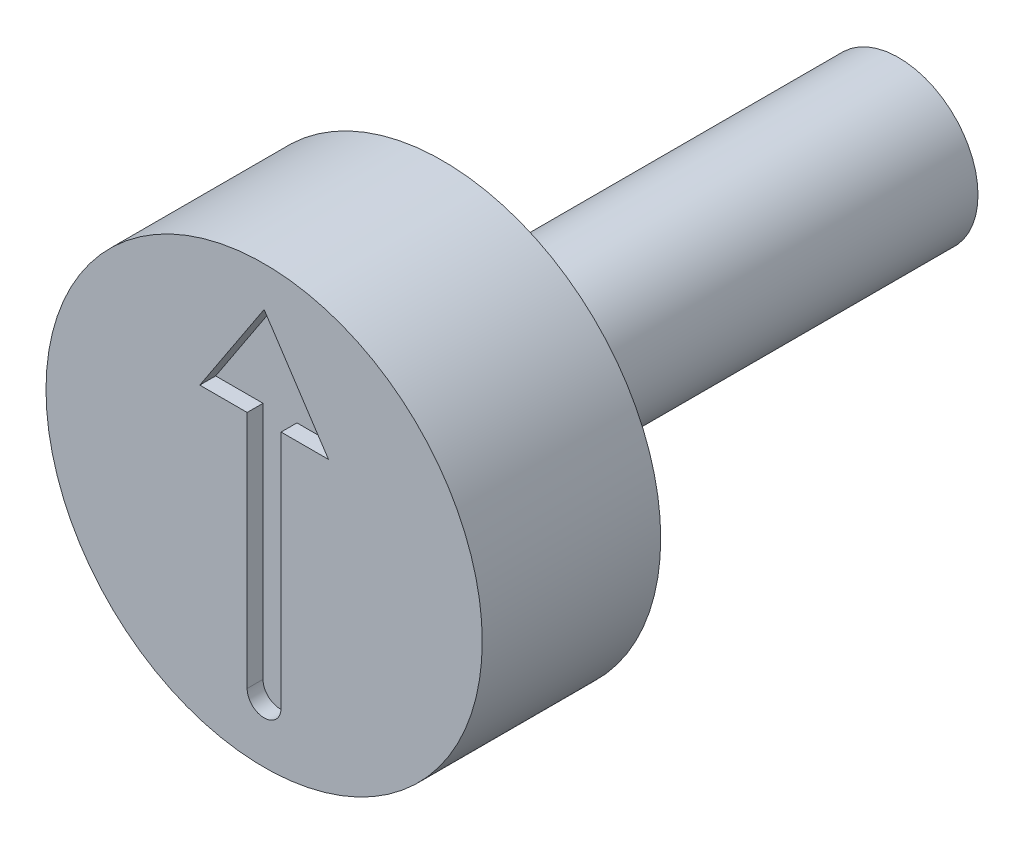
ISO-10303-21;
HEADER;
FILE_DESCRIPTION(('STEP AP214'),'2;1');
FILE_NAME('part.step','',(''),(''),'','','');
FILE_SCHEMA(('AUTOMOTIVE_DESIGN { 1 0 10303 214 1 1 1 1 }'));
ENDSEC;
DATA;
#1=APPLICATION_CONTEXT('core data for automotive mechanical design processes');
#2=APPLICATION_PROTOCOL_DEFINITION('international standard','automotive_design',2000,#1);
#3=PRODUCT_CONTEXT('',#1,'mechanical');
#4=PRODUCT('Part','Part','',(#3));
#5=PRODUCT_RELATED_PRODUCT_CATEGORY('part','',(#4));
#6=PRODUCT_DEFINITION_FORMATION('','',#4);
#7=PRODUCT_DEFINITION_CONTEXT('part definition',#1,'design');
#8=PRODUCT_DEFINITION('design','',#6,#7);
#9=PRODUCT_DEFINITION_SHAPE('','',#8);
#10=(LENGTH_UNIT() NAMED_UNIT(*) SI_UNIT(.MILLI.,.METRE.));
#11=(NAMED_UNIT(*) PLANE_ANGLE_UNIT() SI_UNIT($,.RADIAN.));
#12=(NAMED_UNIT(*) SI_UNIT($,.STERADIAN.) SOLID_ANGLE_UNIT());
#13=UNCERTAINTY_MEASURE_WITH_UNIT(LENGTH_MEASURE(1.E-05),#10,'distance_accuracy_value','');
#14=(GEOMETRIC_REPRESENTATION_CONTEXT(3) GLOBAL_UNCERTAINTY_ASSIGNED_CONTEXT((#13)) GLOBAL_UNIT_ASSIGNED_CONTEXT((#10,
#11,#12)) REPRESENTATION_CONTEXT('',''));
#15=CARTESIAN_POINT('',(0.,0.,0.));
#16=DIRECTION('',(0.,0.,1.));
#17=DIRECTION('',(1.,0.,0.));
#18=AXIS2_PLACEMENT_3D('',#15,#16,#17);
#19=CARTESIAN_POINT('',(0.,0.,0.));
#20=DIRECTION('',(0.,0.,1.));
#21=DIRECTION('',(1.,0.,0.));
#22=AXIS2_PLACEMENT_3D('',#19,#20,#21);
#23=PLANE('',#22);
#24=DIRECTION('',(1.,0.,0.));
#25=VECTOR('',#24,1.);
#26=CARTESIAN_POINT('',(0.428009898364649,2.03665157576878,0.));
#27=LINE('',#26,#25);
#28=CARTESIAN_POINT('',(0.428009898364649,2.03665157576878,0.));
#29=VERTEX_POINT('',#28);
#30=CARTESIAN_POINT('',(1.6222126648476,2.03665157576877,0.));
#31=VERTEX_POINT('',#30);
#32=EDGE_CURVE('E48',#29,#31,#27,.T.);
#33=ORIENTED_EDGE('',*,*,#32,.F.);
#34=DIRECTION('',(0.,1.,0.));
#35=VECTOR('',#34,1.);
#36=CARTESIAN_POINT('',(0.42800989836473,-3.99119224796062,0.));
#37=LINE('',#36,#35);
#38=CARTESIAN_POINT('',(0.42800989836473,-3.99119224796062,0.));
#39=VERTEX_POINT('',#38);
#40=EDGE_CURVE('E140',#39,#29,#37,.T.);
#41=ORIENTED_EDGE('',*,*,#40,.F.);
#42=CARTESIAN_POINT('',(0.,-3.99119224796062,0.));
#43=DIRECTION('',(0.,0.,1.));
#44=DIRECTION('',(1.,0.,0.));
#45=AXIS2_PLACEMENT_3D('',#42,#43,#44);
#46=CIRCLE('',#45,0.42800989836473);
#47=CARTESIAN_POINT('',(-0.42800989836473,-3.99119224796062,0.));
#48=VERTEX_POINT('',#47);
#49=EDGE_CURVE('E138',#48,#39,#46,.T.);
#50=ORIENTED_EDGE('',*,*,#49,.F.);
#51=DIRECTION('',(0.,-1.,0.));
#52=VECTOR('',#51,1.);
#53=CARTESIAN_POINT('',(-0.42800989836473,-3.99119224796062,0.));
#54=LINE('',#53,#52);
#55=CARTESIAN_POINT('',(-0.428009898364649,2.03665157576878,0.));
#56=VERTEX_POINT('',#55);
#57=EDGE_CURVE('E102',#56,#48,#54,.T.);
#58=ORIENTED_EDGE('',*,*,#57,.F.);
#59=DIRECTION('',(1.,0.,0.));
#60=VECTOR('',#59,1.);
#61=CARTESIAN_POINT('',(-0.428009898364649,2.03665157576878,0.));
#62=LINE('',#61,#60);
#63=CARTESIAN_POINT('',(-1.6222126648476,2.03665157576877,0.));
#64=VERTEX_POINT('',#63);
#65=EDGE_CURVE('E134',#64,#56,#62,.T.);
#66=ORIENTED_EDGE('',*,*,#65,.F.);
#67=DIRECTION('',(-0.550159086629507,-0.835059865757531,0.));
#68=VECTOR('',#67,1.);
#69=CARTESIAN_POINT('',(-1.6222126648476,2.03665157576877,0.));
#70=LINE('',#69,#68);
#71=CARTESIAN_POINT('',(0.,4.49892971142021,0.));
#72=VERTEX_POINT('',#71);
#73=EDGE_CURVE('E131',#72,#64,#70,.T.);
#74=ORIENTED_EDGE('',*,*,#73,.F.);
#75=DIRECTION('',(-0.550159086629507,0.835059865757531,0.));
#76=VECTOR('',#75,1.);
#77=CARTESIAN_POINT('',(1.6222126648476,2.03665157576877,0.));
#78=LINE('',#77,#76);
#79=EDGE_CURVE('E128',#31,#72,#78,.T.);
#80=ORIENTED_EDGE('',*,*,#79,.F.);
#81=EDGE_LOOP('',(#33,#41,#50,#58,#66,#74,#80));
#82=FACE_BOUND('',#81,.T.);
#83=CARTESIAN_POINT('',(0.,0.,0.));
#84=DIRECTION('',(0.,0.,1.));
#85=DIRECTION('',(1.,0.,0.));
#86=AXIS2_PLACEMENT_3D('',#83,#84,#85);
#87=CIRCLE('',#86,5.5);
#88=CARTESIAN_POINT('',(5.5,0.,0.));
#89=VERTEX_POINT('',#88);
#90=EDGE_CURVE('E11',#89,#89,#87,.T.);
#91=ORIENTED_EDGE('',*,*,#90,.T.);
#92=EDGE_LOOP('',(#91));
#93=FACE_BOUND('',#92,.T.);
#94=ADVANCED_FACE('F34',(#82,#93),#23,.T.);
#95=CARTESIAN_POINT('',(0.,0.,0.));
#96=DIRECTION('',(0.,0.,1.));
#97=DIRECTION('',(1.,0.,0.));
#98=AXIS2_PLACEMENT_3D('',#95,#96,#97);
#99=CYLINDRICAL_SURFACE('',#98,5.5);
#100=CARTESIAN_POINT('',(0.,0.,-4.5));
#101=DIRECTION('',(0.,0.,1.));
#102=DIRECTION('',(1.,0.,0.));
#103=AXIS2_PLACEMENT_3D('',#100,#101,#102);
#104=CIRCLE('',#103,5.5);
#105=CARTESIAN_POINT('',(5.5,0.,-4.5));
#106=VERTEX_POINT('',#105);
#107=EDGE_CURVE('E41',#106,#106,#104,.T.);
#108=ORIENTED_EDGE('',*,*,#107,.T.);
#109=EDGE_LOOP('',(#108));
#110=FACE_BOUND('',#109,.T.);
#111=ORIENTED_EDGE('',*,*,#90,.F.);
#112=EDGE_LOOP('',(#111));
#113=FACE_BOUND('',#112,.T.);
#114=ADVANCED_FACE('F159',(#110,#113),#99,.T.);
#115=CARTESIAN_POINT('',(5.5,0.,-4.5));
#116=DIRECTION('',(0.,0.,-1.));
#117=DIRECTION('',(-1.,0.,0.));
#118=AXIS2_PLACEMENT_3D('',#115,#116,#117);
#119=PLANE('',#118);
#120=CARTESIAN_POINT('',(0.,0.,-4.5));
#121=DIRECTION('',(0.,0.,1.));
#122=DIRECTION('',(1.,0.,0.));
#123=AXIS2_PLACEMENT_3D('',#120,#121,#122);
#124=CIRCLE('',#123,2.);
#125=CARTESIAN_POINT('',(2.,0.,-4.5));
#126=VERTEX_POINT('',#125);
#127=EDGE_CURVE('E154',#126,#126,#124,.T.);
#128=ORIENTED_EDGE('',*,*,#127,.T.);
#129=EDGE_LOOP('',(#128));
#130=FACE_BOUND('',#129,.T.);
#131=ORIENTED_EDGE('',*,*,#107,.F.);
#132=EDGE_LOOP('',(#131));
#133=FACE_BOUND('',#132,.T.);
#134=ADVANCED_FACE('F162',(#130,#133),#119,.T.);
#135=CARTESIAN_POINT('',(0.,0.,0.));
#136=DIRECTION('',(0.,0.,1.));
#137=DIRECTION('',(1.,0.,0.));
#138=AXIS2_PLACEMENT_3D('',#135,#136,#137);
#139=CYLINDRICAL_SURFACE('',#138,2.);
#140=CARTESIAN_POINT('',(0.,0.,-16.));
#141=DIRECTION('',(0.,0.,1.));
#142=DIRECTION('',(1.,0.,0.));
#143=AXIS2_PLACEMENT_3D('',#140,#141,#142);
#144=CIRCLE('',#143,2.);
#145=CARTESIAN_POINT('',(2.,0.,-16.));
#146=VERTEX_POINT('',#145);
#147=EDGE_CURVE('E144',#146,#146,#144,.T.);
#148=ORIENTED_EDGE('',*,*,#147,.T.);
#149=EDGE_LOOP('',(#148));
#150=FACE_BOUND('',#149,.T.);
#151=ORIENTED_EDGE('',*,*,#127,.F.);
#152=EDGE_LOOP('',(#151));
#153=FACE_BOUND('',#152,.T.);
#154=ADVANCED_FACE('F164',(#150,#153),#139,.T.);
#155=CARTESIAN_POINT('',(2.,0.,-16.));
#156=DIRECTION('',(0.,0.,-1.));
#157=DIRECTION('',(-1.,0.,0.));
#158=AXIS2_PLACEMENT_3D('',#155,#156,#157);
#159=PLANE('',#158);
#160=ORIENTED_EDGE('',*,*,#147,.F.);
#161=EDGE_LOOP('',(#160));
#162=FACE_BOUND('',#161,.T.);
#163=ADVANCED_FACE('F171',(#162),#159,.T.);
#164=CARTESIAN_POINT('',(0.428009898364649,2.03665157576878,-0.4));
#165=DIRECTION('',(0.,-1.,0.));
#166=DIRECTION('',(1.,0.,0.));
#167=AXIS2_PLACEMENT_3D('',#164,#165,#166);
#168=PLANE('',#167);
#169=ORIENTED_EDGE('',*,*,#32,.T.);
#170=DIRECTION('',(0.,0.,1.));
#171=VECTOR('',#170,1.);
#172=CARTESIAN_POINT('',(1.6222126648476,2.03665157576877,-0.4));
#173=LINE('',#172,#171);
#174=CARTESIAN_POINT('',(1.6222126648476,2.03665157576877,-0.4));
#175=VERTEX_POINT('',#174);
#176=EDGE_CURVE('E81',#175,#31,#173,.T.);
#177=ORIENTED_EDGE('',*,*,#176,.F.);
#178=DIRECTION('',(1.,0.,0.));
#179=VECTOR('',#178,1.);
#180=CARTESIAN_POINT('',(0.428009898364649,2.03665157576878,-0.4));
#181=LINE('',#180,#179);
#182=CARTESIAN_POINT('',(0.428009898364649,2.03665157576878,-0.4));
#183=VERTEX_POINT('',#182);
#184=EDGE_CURVE('E142',#183,#175,#181,.T.);
#185=ORIENTED_EDGE('',*,*,#184,.F.);
#186=DIRECTION('',(0.,0.,1.));
#187=VECTOR('',#186,1.);
#188=CARTESIAN_POINT('',(0.428009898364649,2.03665157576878,-0.4));
#189=LINE('',#188,#187);
#190=EDGE_CURVE('E56',#183,#29,#189,.T.);
#191=ORIENTED_EDGE('',*,*,#190,.T.);
#192=EDGE_LOOP('',(#169,#177,#185,#191));
#193=FACE_BOUND('',#192,.T.);
#194=ADVANCED_FACE('F207',(#193),#168,.F.);
#195=CARTESIAN_POINT('',(0.42800989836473,-3.99119224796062,-0.4));
#196=DIRECTION('',(1.,0.,0.));
#197=DIRECTION('',(0.,1.,0.));
#198=AXIS2_PLACEMENT_3D('',#195,#196,#197);
#199=PLANE('',#198);
#200=ORIENTED_EDGE('',*,*,#40,.T.);
#201=ORIENTED_EDGE('',*,*,#190,.F.);
#202=DIRECTION('',(0.,1.,0.));
#203=VECTOR('',#202,1.);
#204=CARTESIAN_POINT('',(0.42800989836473,-3.99119224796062,-0.4));
#205=LINE('',#204,#203);
#206=CARTESIAN_POINT('',(0.42800989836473,-3.99119224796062,-0.4));
#207=VERTEX_POINT('',#206);
#208=EDGE_CURVE('E114',#207,#183,#205,.T.);
#209=ORIENTED_EDGE('',*,*,#208,.F.);
#210=DIRECTION('',(0.,0.,1.));
#211=VECTOR('',#210,1.);
#212=CARTESIAN_POINT('',(0.42800989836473,-3.99119224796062,-0.4));
#213=LINE('',#212,#211);
#214=EDGE_CURVE('E106',#207,#39,#213,.T.);
#215=ORIENTED_EDGE('',*,*,#214,.T.);
#216=EDGE_LOOP('',(#200,#201,#209,#215));
#217=FACE_BOUND('',#216,.T.);
#218=ADVANCED_FACE('F210',(#217),#199,.F.);
#219=CARTESIAN_POINT('',(0.,-3.99119224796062,-0.4));
#220=DIRECTION('',(0.,0.,1.));
#221=DIRECTION('',(1.,0.,0.));
#222=AXIS2_PLACEMENT_3D('',#219,#220,#221);
#223=CYLINDRICAL_SURFACE('',#222,0.42800989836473);
#224=ORIENTED_EDGE('',*,*,#49,.T.);
#225=ORIENTED_EDGE('',*,*,#214,.F.);
#226=CARTESIAN_POINT('',(0.,-3.99119224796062,-0.4));
#227=DIRECTION('',(0.,0.,1.));
#228=DIRECTION('',(1.,0.,0.));
#229=AXIS2_PLACEMENT_3D('',#226,#227,#228);
#230=CIRCLE('',#229,0.42800989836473);
#231=CARTESIAN_POINT('',(-0.42800989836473,-3.99119224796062,-0.4));
#232=VERTEX_POINT('',#231);
#233=EDGE_CURVE('E110',#232,#207,#230,.T.);
#234=ORIENTED_EDGE('',*,*,#233,.F.);
#235=DIRECTION('',(0.,0.,1.));
#236=VECTOR('',#235,1.);
#237=CARTESIAN_POINT('',(-0.42800989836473,-3.99119224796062,-0.4));
#238=LINE('',#237,#236);
#239=EDGE_CURVE('E95',#232,#48,#238,.T.);
#240=ORIENTED_EDGE('',*,*,#239,.T.);
#241=EDGE_LOOP('',(#224,#225,#234,#240));
#242=FACE_BOUND('',#241,.T.);
#243=ADVANCED_FACE('F111',(#242),#223,.F.);
#244=CARTESIAN_POINT('',(-0.42800989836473,-3.99119224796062,-0.4));
#245=DIRECTION('',(-1.,0.,0.));
#246=DIRECTION('',(0.,-1.,0.));
#247=AXIS2_PLACEMENT_3D('',#244,#245,#246);
#248=PLANE('',#247);
#249=ORIENTED_EDGE('',*,*,#57,.T.);
#250=ORIENTED_EDGE('',*,*,#239,.F.);
#251=DIRECTION('',(0.,-1.,0.));
#252=VECTOR('',#251,1.);
#253=CARTESIAN_POINT('',(-0.42800989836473,-3.99119224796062,-0.4));
#254=LINE('',#253,#252);
#255=CARTESIAN_POINT('',(-0.428009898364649,2.03665157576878,-0.4));
#256=VERTEX_POINT('',#255);
#257=EDGE_CURVE('E99',#256,#232,#254,.T.);
#258=ORIENTED_EDGE('',*,*,#257,.F.);
#259=DIRECTION('',(0.,0.,1.));
#260=VECTOR('',#259,1.);
#261=CARTESIAN_POINT('',(-0.428009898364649,2.03665157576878,-0.4));
#262=LINE('',#261,#260);
#263=EDGE_CURVE('E107',#256,#56,#262,.T.);
#264=ORIENTED_EDGE('',*,*,#263,.T.);
#265=EDGE_LOOP('',(#249,#250,#258,#264));
#266=FACE_BOUND('',#265,.T.);
#267=ADVANCED_FACE('F97',(#266),#248,.F.);
#268=CARTESIAN_POINT('',(-0.428009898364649,2.03665157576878,-0.4));
#269=DIRECTION('',(0.,-1.,0.));
#270=DIRECTION('',(1.,0.,0.));
#271=AXIS2_PLACEMENT_3D('',#268,#269,#270);
#272=PLANE('',#271);
#273=ORIENTED_EDGE('',*,*,#65,.T.);
#274=ORIENTED_EDGE('',*,*,#263,.F.);
#275=DIRECTION('',(1.,0.,0.));
#276=VECTOR('',#275,1.);
#277=CARTESIAN_POINT('',(-0.428009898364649,2.03665157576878,-0.4));
#278=LINE('',#277,#276);
#279=CARTESIAN_POINT('',(-1.6222126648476,2.03665157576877,-0.4));
#280=VERTEX_POINT('',#279);
#281=EDGE_CURVE('E120',#280,#256,#278,.T.);
#282=ORIENTED_EDGE('',*,*,#281,.F.);
#283=DIRECTION('',(0.,0.,1.));
#284=VECTOR('',#283,1.);
#285=CARTESIAN_POINT('',(-1.6222126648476,2.03665157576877,-0.4));
#286=LINE('',#285,#284);
#287=EDGE_CURVE('E147',#280,#64,#286,.T.);
#288=ORIENTED_EDGE('',*,*,#287,.T.);
#289=EDGE_LOOP('',(#273,#274,#282,#288));
#290=FACE_BOUND('',#289,.T.);
#291=ADVANCED_FACE('F194',(#290),#272,.F.);
#292=CARTESIAN_POINT('',(-1.6222126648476,2.03665157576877,-0.4));
#293=DIRECTION('',(-0.835059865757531,0.550159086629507,0.));
#294=DIRECTION('',(-0.550159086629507,-0.835059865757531,0.));
#295=AXIS2_PLACEMENT_3D('',#292,#293,#294);
#296=PLANE('',#295);
#297=ORIENTED_EDGE('',*,*,#73,.T.);
#298=ORIENTED_EDGE('',*,*,#287,.F.);
#299=DIRECTION('',(-0.550159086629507,-0.835059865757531,0.));
#300=VECTOR('',#299,1.);
#301=CARTESIAN_POINT('',(-1.6222126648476,2.03665157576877,-0.4));
#302=LINE('',#301,#300);
#303=CARTESIAN_POINT('',(0.,4.49892971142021,-0.4));
#304=VERTEX_POINT('',#303);
#305=EDGE_CURVE('E122',#304,#280,#302,.T.);
#306=ORIENTED_EDGE('',*,*,#305,.F.);
#307=DIRECTION('',(0.,0.,1.));
#308=VECTOR('',#307,1.);
#309=CARTESIAN_POINT('',(0.,4.49892971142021,-0.4));
#310=LINE('',#309,#308);
#311=EDGE_CURVE('E149',#304,#72,#310,.T.);
#312=ORIENTED_EDGE('',*,*,#311,.T.);
#313=EDGE_LOOP('',(#297,#298,#306,#312));
#314=FACE_BOUND('',#313,.T.);
#315=ADVANCED_FACE('F192',(#314),#296,.F.);
#316=CARTESIAN_POINT('',(1.6222126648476,2.03665157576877,-0.4));
#317=DIRECTION('',(0.835059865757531,0.550159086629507,0.));
#318=DIRECTION('',(-0.550159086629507,0.835059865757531,0.));
#319=AXIS2_PLACEMENT_3D('',#316,#317,#318);
#320=PLANE('',#319);
#321=ORIENTED_EDGE('',*,*,#79,.T.);
#322=ORIENTED_EDGE('',*,*,#311,.F.);
#323=DIRECTION('',(-0.550159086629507,0.835059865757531,0.));
#324=VECTOR('',#323,1.);
#325=CARTESIAN_POINT('',(1.6222126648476,2.03665157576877,-0.4));
#326=LINE('',#325,#324);
#327=EDGE_CURVE('E188',#175,#304,#326,.T.);
#328=ORIENTED_EDGE('',*,*,#327,.F.);
#329=ORIENTED_EDGE('',*,*,#176,.T.);
#330=EDGE_LOOP('',(#321,#322,#328,#329));
#331=FACE_BOUND('',#330,.T.);
#332=ADVANCED_FACE('F185',(#331),#320,.F.);
#333=CARTESIAN_POINT('',(0.,-3.99119224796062,-0.4));
#334=DIRECTION('',(0.,0.,1.));
#335=DIRECTION('',(1.,0.,0.));
#336=AXIS2_PLACEMENT_3D('',#333,#334,#335);
#337=PLANE('',#336);
#338=ORIENTED_EDGE('',*,*,#184,.T.);
#339=ORIENTED_EDGE('',*,*,#327,.T.);
#340=ORIENTED_EDGE('',*,*,#305,.T.);
#341=ORIENTED_EDGE('',*,*,#281,.T.);
#342=ORIENTED_EDGE('',*,*,#257,.T.);
#343=ORIENTED_EDGE('',*,*,#233,.T.);
#344=ORIENTED_EDGE('',*,*,#208,.T.);
#345=EDGE_LOOP('',(#338,#339,#340,#341,#342,#343,#344));
#346=FACE_BOUND('',#345,.T.);
#347=ADVANCED_FACE('F117',(#346),#337,.T.);
#348=CLOSED_SHELL('',(#94,#114,#134,#154,#163,#194,#218,#243,#267,#291,#315,#332,#347));
#349=MANIFOLD_SOLID_BREP('B2',#348);
#350=ADVANCED_BREP_SHAPE_REPRESENTATION('',(#18,#349),#14);
#351=SHAPE_DEFINITION_REPRESENTATION(#9,#350);
ENDSEC;
END-ISO-10303-21;
